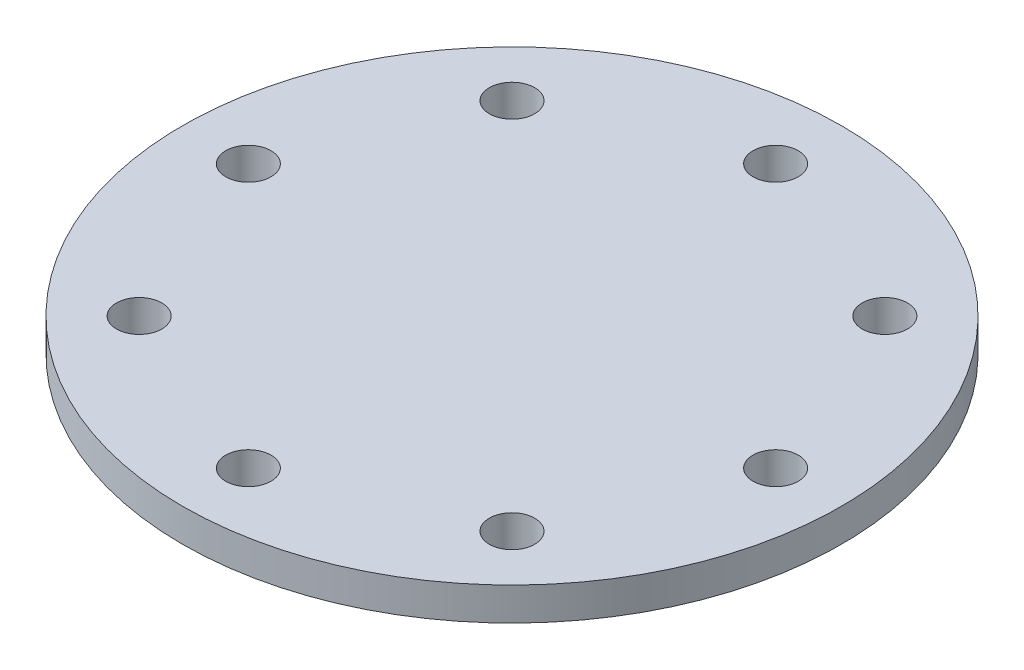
from build123d import *

# Parameters (mm, degrees)
SKETCH2_R                       = 127
EXTRUDE1_DEPTH                  = 12.7
F_11_16_0_6875_DIAMETER_HOLE1_D = 17.4625
CIRPATTERN1_COUNT               = 8


with BuildPart() as part:
    # Sketch2 → Extrude1 (new body)
    with BuildSketch(Plane(origin=(0, 0, 0), x_dir=(1, 0, 0), z_dir=(0, 1, 0))):
        with Locations(Location((0, 0, 0), (0, 0, 270))):
            Circle(SKETCH2_R)
    extrude(amount=EXTRUDE1_DEPTH)

    # 11_16 _0.6875_ Diameter Hole1 (through all)
    with Locations(Plane(origin=(0, 12.7, 0), x_dir=(-1, 0, 0), z_dir=(0, 1, 0))):
        with Locations((-101.6, 0)):
            f_11_16_0_6875_diameter_hole1 = Hole(F_11_16_0_6875_DIAMETER_HOLE1_D / 2)

    # CirPattern1: 11_16 _0.6875_ Diameter Hole1 ×8 about axis
    cirpattern1_axis = Axis((0, 0, 0), (0, 1, 0))
    for i in range(1, CIRPATTERN1_COUNT):
        add(f_11_16_0_6875_diameter_hole1.rotate(cirpattern1_axis, i * 360 / CIRPATTERN1_COUNT), mode=Mode.SUBTRACT)


solid = part.part
